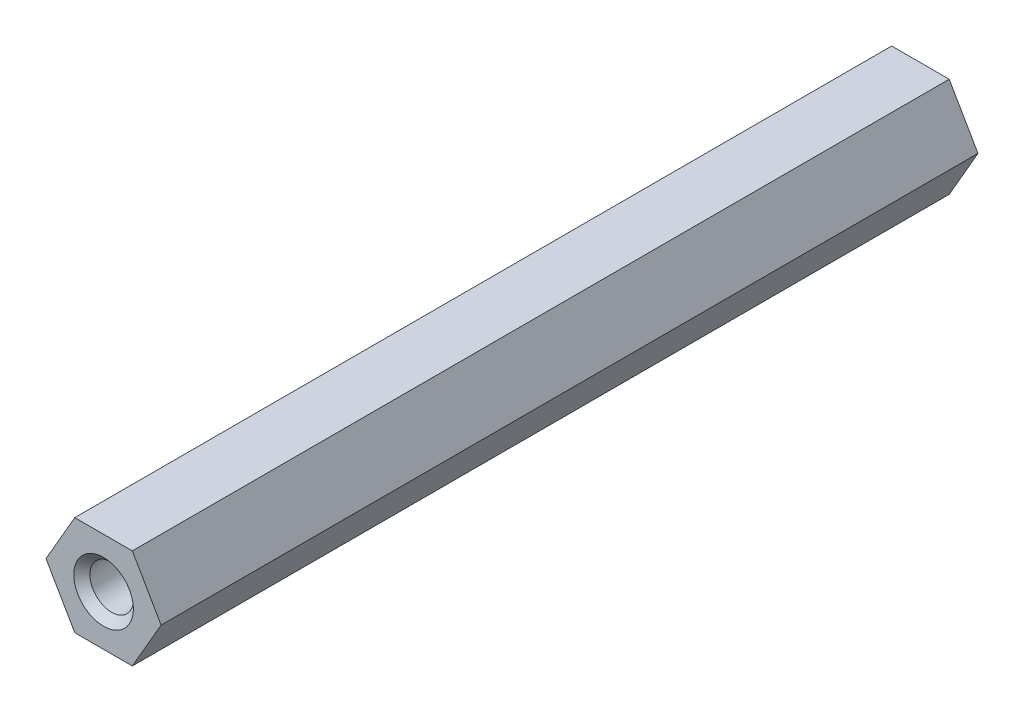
ISO-10303-21;
HEADER;
FILE_DESCRIPTION(('STEP AP214'),'2;1');
FILE_NAME('part.step','',(''),(''),'','','');
FILE_SCHEMA(('AUTOMOTIVE_DESIGN { 1 0 10303 214 1 1 1 1 }'));
ENDSEC;
DATA;
#1=APPLICATION_CONTEXT('core data for automotive mechanical design processes');
#2=APPLICATION_PROTOCOL_DEFINITION('international standard','automotive_design',2000,#1);
#3=PRODUCT_CONTEXT('',#1,'mechanical');
#4=PRODUCT('Part','Part','',(#3));
#5=PRODUCT_RELATED_PRODUCT_CATEGORY('part','',(#4));
#6=PRODUCT_DEFINITION_FORMATION('','',#4);
#7=PRODUCT_DEFINITION_CONTEXT('part definition',#1,'design');
#8=PRODUCT_DEFINITION('design','',#6,#7);
#9=PRODUCT_DEFINITION_SHAPE('','',#8);
#10=(LENGTH_UNIT() NAMED_UNIT(*) SI_UNIT(.MILLI.,.METRE.));
#11=(NAMED_UNIT(*) PLANE_ANGLE_UNIT() SI_UNIT($,.RADIAN.));
#12=(NAMED_UNIT(*) SI_UNIT($,.STERADIAN.) SOLID_ANGLE_UNIT());
#13=UNCERTAINTY_MEASURE_WITH_UNIT(LENGTH_MEASURE(1.E-05),#10,'distance_accuracy_value','');
#14=(GEOMETRIC_REPRESENTATION_CONTEXT(3) GLOBAL_UNCERTAINTY_ASSIGNED_CONTEXT((#13)) GLOBAL_UNIT_ASSIGNED_CONTEXT((#10,
#11,#12)) REPRESENTATION_CONTEXT('',''));
#15=CARTESIAN_POINT('',(0.,0.,0.));
#16=DIRECTION('',(0.,0.,1.));
#17=DIRECTION('',(1.,0.,0.));
#18=AXIS2_PLACEMENT_3D('',#15,#16,#17);
#19=CARTESIAN_POINT('',(1.78978583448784,-3.1,-50.8));
#20=DIRECTION('',(0.866025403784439,-0.5,0.));
#21=DIRECTION('',(0.5,0.866025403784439,0.));
#22=AXIS2_PLACEMENT_3D('',#19,#20,#21);
#23=PLANE('',#22);
#24=DIRECTION('',(0.5,0.866025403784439,0.));
#25=VECTOR('',#24,1.);
#26=CARTESIAN_POINT('',(1.78978583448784,-3.1,0.));
#27=LINE('',#26,#25);
#28=CARTESIAN_POINT('',(1.78978583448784,-3.1,0.));
#29=VERTEX_POINT('',#28);
#30=CARTESIAN_POINT('',(3.57957166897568,0.,0.));
#31=VERTEX_POINT('',#30);
#32=EDGE_CURVE('E119',#29,#31,#27,.T.);
#33=ORIENTED_EDGE('',*,*,#32,.F.);
#34=DIRECTION('',(0.,0.,1.));
#35=VECTOR('',#34,1.);
#36=CARTESIAN_POINT('',(1.78978583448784,-3.1,-50.8));
#37=LINE('',#36,#35);
#38=CARTESIAN_POINT('',(1.78978583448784,-3.1,-50.8));
#39=VERTEX_POINT('',#38);
#40=EDGE_CURVE('E48',#39,#29,#37,.T.);
#41=ORIENTED_EDGE('',*,*,#40,.F.);
#42=DIRECTION('',(0.5,0.866025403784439,0.));
#43=VECTOR('',#42,1.);
#44=CARTESIAN_POINT('',(1.78978583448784,-3.1,-50.8));
#45=LINE('',#44,#43);
#46=CARTESIAN_POINT('',(3.57957166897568,0.,-50.8));
#47=VERTEX_POINT('',#46);
#48=EDGE_CURVE('E134',#39,#47,#45,.T.);
#49=ORIENTED_EDGE('',*,*,#48,.T.);
#50=DIRECTION('',(0.,0.,1.));
#51=VECTOR('',#50,1.);
#52=CARTESIAN_POINT('',(3.57957166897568,0.,-50.8));
#53=LINE('',#52,#51);
#54=EDGE_CURVE('E83',#47,#31,#53,.T.);
#55=ORIENTED_EDGE('',*,*,#54,.T.);
#56=EDGE_LOOP('',(#33,#41,#49,#55));
#57=FACE_BOUND('',#56,.T.);
#58=ADVANCED_FACE('F31',(#57),#23,.T.);
#59=CARTESIAN_POINT('',(-1.78978583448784,-3.1,-50.8));
#60=DIRECTION('',(0.,-1.,0.));
#61=DIRECTION('',(0.,0.,-1.));
#62=AXIS2_PLACEMENT_3D('',#59,#60,#61);
#63=PLANE('',#62);
#64=DIRECTION('',(1.,0.,0.));
#65=VECTOR('',#64,1.);
#66=CARTESIAN_POINT('',(-1.78978583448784,-3.1,0.));
#67=LINE('',#66,#65);
#68=CARTESIAN_POINT('',(-1.78978583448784,-3.1,0.));
#69=VERTEX_POINT('',#68);
#70=EDGE_CURVE('E131',#69,#29,#67,.T.);
#71=ORIENTED_EDGE('',*,*,#70,.F.);
#72=DIRECTION('',(0.,0.,1.));
#73=VECTOR('',#72,1.);
#74=CARTESIAN_POINT('',(-1.78978583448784,-3.1,-50.8));
#75=LINE('',#74,#73);
#76=CARTESIAN_POINT('',(-1.78978583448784,-3.1,-50.8));
#77=VERTEX_POINT('',#76);
#78=EDGE_CURVE('E71',#77,#69,#75,.T.);
#79=ORIENTED_EDGE('',*,*,#78,.F.);
#80=DIRECTION('',(1.,0.,0.));
#81=VECTOR('',#80,1.);
#82=CARTESIAN_POINT('',(-1.78978583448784,-3.1,-50.8));
#83=LINE('',#82,#81);
#84=EDGE_CURVE('E109',#77,#39,#83,.T.);
#85=ORIENTED_EDGE('',*,*,#84,.T.);
#86=ORIENTED_EDGE('',*,*,#40,.T.);
#87=EDGE_LOOP('',(#71,#79,#85,#86));
#88=FACE_BOUND('',#87,.T.);
#89=ADVANCED_FACE('F160',(#88),#63,.T.);
#90=CARTESIAN_POINT('',(-3.57957166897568,0.,-50.8));
#91=DIRECTION('',(-0.866025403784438,-0.5,0.));
#92=DIRECTION('',(0.5,-0.866025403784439,0.));
#93=AXIS2_PLACEMENT_3D('',#90,#91,#92);
#94=PLANE('',#93);
#95=DIRECTION('',(0.5,-0.866025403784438,0.));
#96=VECTOR('',#95,1.);
#97=CARTESIAN_POINT('',(-3.57957166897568,0.,0.));
#98=LINE('',#97,#96);
#99=CARTESIAN_POINT('',(-3.57957166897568,0.,0.));
#100=VERTEX_POINT('',#99);
#101=EDGE_CURVE('E96',#100,#69,#98,.T.);
#102=ORIENTED_EDGE('',*,*,#101,.F.);
#103=DIRECTION('',(0.,0.,1.));
#104=VECTOR('',#103,1.);
#105=CARTESIAN_POINT('',(-3.57957166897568,0.,-50.8));
#106=LINE('',#105,#104);
#107=CARTESIAN_POINT('',(-3.57957166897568,0.,-50.8));
#108=VERTEX_POINT('',#107);
#109=EDGE_CURVE('E91',#108,#100,#106,.T.);
#110=ORIENTED_EDGE('',*,*,#109,.F.);
#111=DIRECTION('',(0.5,-0.866025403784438,0.));
#112=VECTOR('',#111,1.);
#113=CARTESIAN_POINT('',(-3.57957166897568,0.,-50.8));
#114=LINE('',#113,#112);
#115=EDGE_CURVE('E94',#108,#77,#114,.T.);
#116=ORIENTED_EDGE('',*,*,#115,.T.);
#117=ORIENTED_EDGE('',*,*,#78,.T.);
#118=EDGE_LOOP('',(#102,#110,#116,#117));
#119=FACE_BOUND('',#118,.T.);
#120=ADVANCED_FACE('F93',(#119),#94,.T.);
#121=CARTESIAN_POINT('',(-1.78978583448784,3.1,-50.8));
#122=DIRECTION('',(-0.866025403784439,0.5,0.));
#123=DIRECTION('',(-0.5,-0.866025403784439,0.));
#124=AXIS2_PLACEMENT_3D('',#121,#122,#123);
#125=PLANE('',#124);
#126=DIRECTION('',(-0.5,-0.866025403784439,0.));
#127=VECTOR('',#126,1.);
#128=CARTESIAN_POINT('',(-1.78978583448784,3.1,0.));
#129=LINE('',#128,#127);
#130=CARTESIAN_POINT('',(-1.78978583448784,3.1,0.));
#131=VERTEX_POINT('',#130);
#132=EDGE_CURVE('E128',#131,#100,#129,.T.);
#133=ORIENTED_EDGE('',*,*,#132,.F.);
#134=DIRECTION('',(0.,0.,1.));
#135=VECTOR('',#134,1.);
#136=CARTESIAN_POINT('',(-1.78978583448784,3.1,-50.8));
#137=LINE('',#136,#135);
#138=CARTESIAN_POINT('',(-1.78978583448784,3.1,-50.8));
#139=VERTEX_POINT('',#138);
#140=EDGE_CURVE('E101',#139,#131,#137,.T.);
#141=ORIENTED_EDGE('',*,*,#140,.F.);
#142=DIRECTION('',(-0.5,-0.866025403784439,0.));
#143=VECTOR('',#142,1.);
#144=CARTESIAN_POINT('',(-1.78978583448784,3.1,-50.8));
#145=LINE('',#144,#143);
#146=EDGE_CURVE('E107',#139,#108,#145,.T.);
#147=ORIENTED_EDGE('',*,*,#146,.T.);
#148=ORIENTED_EDGE('',*,*,#109,.T.);
#149=EDGE_LOOP('',(#133,#141,#147,#148));
#150=FACE_BOUND('',#149,.T.);
#151=ADVANCED_FACE('F111',(#150),#125,.T.);
#152=CARTESIAN_POINT('',(1.78978583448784,3.1,-50.8));
#153=DIRECTION('',(0.,1.,0.));
#154=DIRECTION('',(-1.,0.,0.));
#155=AXIS2_PLACEMENT_3D('',#152,#153,#154);
#156=PLANE('',#155);
#157=DIRECTION('',(-1.,0.,0.));
#158=VECTOR('',#157,1.);
#159=CARTESIAN_POINT('',(1.78978583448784,3.1,0.));
#160=LINE('',#159,#158);
#161=CARTESIAN_POINT('',(1.78978583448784,3.1,0.));
#162=VERTEX_POINT('',#161);
#163=EDGE_CURVE('E125',#162,#131,#160,.T.);
#164=ORIENTED_EDGE('',*,*,#163,.F.);
#165=DIRECTION('',(0.,0.,1.));
#166=VECTOR('',#165,1.);
#167=CARTESIAN_POINT('',(1.78978583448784,3.1,-50.8));
#168=LINE('',#167,#166);
#169=CARTESIAN_POINT('',(1.78978583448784,3.1,-50.8));
#170=VERTEX_POINT('',#169);
#171=EDGE_CURVE('E139',#170,#162,#168,.T.);
#172=ORIENTED_EDGE('',*,*,#171,.F.);
#173=DIRECTION('',(-1.,0.,0.));
#174=VECTOR('',#173,1.);
#175=CARTESIAN_POINT('',(1.78978583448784,3.1,-50.8));
#176=LINE('',#175,#174);
#177=EDGE_CURVE('E112',#170,#139,#176,.T.);
#178=ORIENTED_EDGE('',*,*,#177,.T.);
#179=ORIENTED_EDGE('',*,*,#140,.T.);
#180=EDGE_LOOP('',(#164,#172,#178,#179));
#181=FACE_BOUND('',#180,.T.);
#182=ADVANCED_FACE('F170',(#181),#156,.T.);
#183=CARTESIAN_POINT('',(3.57957166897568,0.,-50.8));
#184=DIRECTION('',(0.866025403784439,0.5,0.));
#185=DIRECTION('',(-0.5,0.866025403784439,0.));
#186=AXIS2_PLACEMENT_3D('',#183,#184,#185);
#187=PLANE('',#186);
#188=DIRECTION('',(-0.5,0.866025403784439,0.));
#189=VECTOR('',#188,1.);
#190=CARTESIAN_POINT('',(3.57957166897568,0.,0.));
#191=LINE('',#190,#189);
#192=EDGE_CURVE('E122',#31,#162,#191,.T.);
#193=ORIENTED_EDGE('',*,*,#192,.F.);
#194=ORIENTED_EDGE('',*,*,#54,.F.);
#195=DIRECTION('',(-0.5,0.866025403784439,0.));
#196=VECTOR('',#195,1.);
#197=CARTESIAN_POINT('',(3.57957166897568,0.,-50.8));
#198=LINE('',#197,#196);
#199=EDGE_CURVE('E114',#47,#170,#198,.T.);
#200=ORIENTED_EDGE('',*,*,#199,.T.);
#201=ORIENTED_EDGE('',*,*,#171,.T.);
#202=EDGE_LOOP('',(#193,#194,#200,#201));
#203=FACE_BOUND('',#202,.T.);
#204=ADVANCED_FACE('F167',(#203),#187,.T.);
#205=CARTESIAN_POINT('',(0.,-6.2,-50.8));
#206=DIRECTION('',(0.,0.,-1.));
#207=DIRECTION('',(-1.,0.,0.));
#208=AXIS2_PLACEMENT_3D('',#205,#206,#207);
#209=PLANE('',#208);
#210=CARTESIAN_POINT('',(0.000428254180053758,0.000741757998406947,-50.8));
#211=DIRECTION('',(0.,0.,-1.));
#212=DIRECTION('',(-1.,0.,0.));
#213=AXIS2_PLACEMENT_3D('',#210,#211,#212);
#214=CIRCLE('',#213,1.85254999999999);
#215=CARTESIAN_POINT('',(-1.85212174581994,0.000741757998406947,-50.8));
#216=VERTEX_POINT('',#215);
#217=EDGE_CURVE('E40',#216,#216,#214,.F.);
#218=ORIENTED_EDGE('',*,*,#217,.T.);
#219=EDGE_LOOP('',(#218));
#220=FACE_BOUND('',#219,.T.);
#221=ORIENTED_EDGE('',*,*,#48,.F.);
#222=ORIENTED_EDGE('',*,*,#84,.F.);
#223=ORIENTED_EDGE('',*,*,#115,.F.);
#224=ORIENTED_EDGE('',*,*,#146,.F.);
#225=ORIENTED_EDGE('',*,*,#177,.F.);
#226=ORIENTED_EDGE('',*,*,#199,.F.);
#227=EDGE_LOOP('',(#221,#222,#223,#224,#225,#226));
#228=FACE_BOUND('',#227,.T.);
#229=ADVANCED_FACE('F105',(#220,#228),#209,.T.);
#230=CARTESIAN_POINT('',(0.,-6.2,0.));
#231=DIRECTION('',(0.,0.,-1.));
#232=DIRECTION('',(-1.,0.,0.));
#233=AXIS2_PLACEMENT_3D('',#230,#231,#232);
#234=PLANE('',#233);
#235=CARTESIAN_POINT('',(0.000428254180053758,0.000741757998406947,0.));
#236=DIRECTION('',(0.,0.,-1.));
#237=DIRECTION('',(-1.,0.,0.));
#238=AXIS2_PLACEMENT_3D('',#235,#236,#237);
#239=CIRCLE('',#238,1.85254999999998);
#240=CARTESIAN_POINT('',(-1.85212174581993,0.000741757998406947,0.));
#241=VERTEX_POINT('',#240);
#242=EDGE_CURVE('E144',#241,#241,#239,.T.);
#243=ORIENTED_EDGE('',*,*,#242,.T.);
#244=EDGE_LOOP('',(#243));
#245=FACE_BOUND('',#244,.T.);
#246=ORIENTED_EDGE('',*,*,#32,.T.);
#247=ORIENTED_EDGE('',*,*,#192,.T.);
#248=ORIENTED_EDGE('',*,*,#163,.T.);
#249=ORIENTED_EDGE('',*,*,#132,.T.);
#250=ORIENTED_EDGE('',*,*,#101,.T.);
#251=ORIENTED_EDGE('',*,*,#70,.T.);
#252=EDGE_LOOP('',(#246,#247,#248,#249,#250,#251));
#253=FACE_BOUND('',#252,.T.);
#254=ADVANCED_FACE('F178',(#245,#253),#234,.F.);
#255=CARTESIAN_POINT('',(0.000428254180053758,0.000741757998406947,0.));
#256=DIRECTION('',(0.,0.,1.));
#257=DIRECTION('',(1.,0.,0.));
#258=AXIS2_PLACEMENT_3D('',#255,#256,#257);
#259=CYLINDRICAL_SURFACE('',#258,1.35254999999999);
#260=CARTESIAN_POINT('',(0.000428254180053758,0.000741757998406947,-50.3));
#261=DIRECTION('',(0.,0.,-1.));
#262=DIRECTION('',(-1.,0.,0.));
#263=AXIS2_PLACEMENT_3D('',#260,#261,#262);
#264=CIRCLE('',#263,1.35254999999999);
#265=CARTESIAN_POINT('',(-1.35212174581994,0.000741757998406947,-50.3));
#266=VERTEX_POINT('',#265);
#267=EDGE_CURVE('E11',#266,#266,#264,.T.);
#268=ORIENTED_EDGE('',*,*,#267,.T.);
#269=EDGE_LOOP('',(#268));
#270=FACE_BOUND('',#269,.T.);
#271=CARTESIAN_POINT('',(0.000428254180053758,0.000741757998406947,-0.499999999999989));
#272=DIRECTION('',(0.,0.,-1.));
#273=DIRECTION('',(-1.,0.,0.));
#274=AXIS2_PLACEMENT_3D('',#271,#272,#273);
#275=CIRCLE('',#274,1.35254999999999);
#276=CARTESIAN_POINT('',(-1.35212174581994,0.000741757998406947,-0.499999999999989));
#277=VERTEX_POINT('',#276);
#278=EDGE_CURVE('E136',#277,#277,#275,.F.);
#279=ORIENTED_EDGE('',*,*,#278,.T.);
#280=EDGE_LOOP('',(#279));
#281=FACE_BOUND('',#280,.T.);
#282=ADVANCED_FACE('F156',(#270,#281),#259,.F.);
#283=CARTESIAN_POINT('',(0.000428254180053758,0.000741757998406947,-0.499999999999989));
#284=DIRECTION('',(0.,0.,1.));
#285=DIRECTION('',(1.,0.,0.));
#286=AXIS2_PLACEMENT_3D('',#283,#284,#285);
#287=CONICAL_SURFACE('',#286,1.35254999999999,0.78539816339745);
#288=ORIENTED_EDGE('',*,*,#242,.F.);
#289=EDGE_LOOP('',(#288));
#290=FACE_BOUND('',#289,.T.);
#291=ORIENTED_EDGE('',*,*,#278,.F.);
#292=EDGE_LOOP('',(#291));
#293=FACE_BOUND('',#292,.T.);
#294=ADVANCED_FACE('F151',(#290,#293),#287,.F.);
#295=CARTESIAN_POINT('',(0.000428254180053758,0.000741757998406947,-50.8));
#296=DIRECTION('',(0.,0.,-1.));
#297=DIRECTION('',(-1.,0.,0.));
#298=AXIS2_PLACEMENT_3D('',#295,#296,#297);
#299=CONICAL_SURFACE('',#298,1.85254999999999,0.785398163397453);
#300=ORIENTED_EDGE('',*,*,#267,.F.);
#301=EDGE_LOOP('',(#300));
#302=FACE_BOUND('',#301,.T.);
#303=ORIENTED_EDGE('',*,*,#217,.F.);
#304=EDGE_LOOP('',(#303));
#305=FACE_BOUND('',#304,.T.);
#306=ADVANCED_FACE('F33',(#302,#305),#299,.F.);
#307=CLOSED_SHELL('',(#58,#89,#120,#151,#182,#204,#229,#254,#282,#294,#306));
#308=MANIFOLD_SOLID_BREP('B2',#307);
#309=ADVANCED_BREP_SHAPE_REPRESENTATION('',(#18,#308),#14);
#310=SHAPE_DEFINITION_REPRESENTATION(#9,#309);
ENDSEC;
END-ISO-10303-21;
